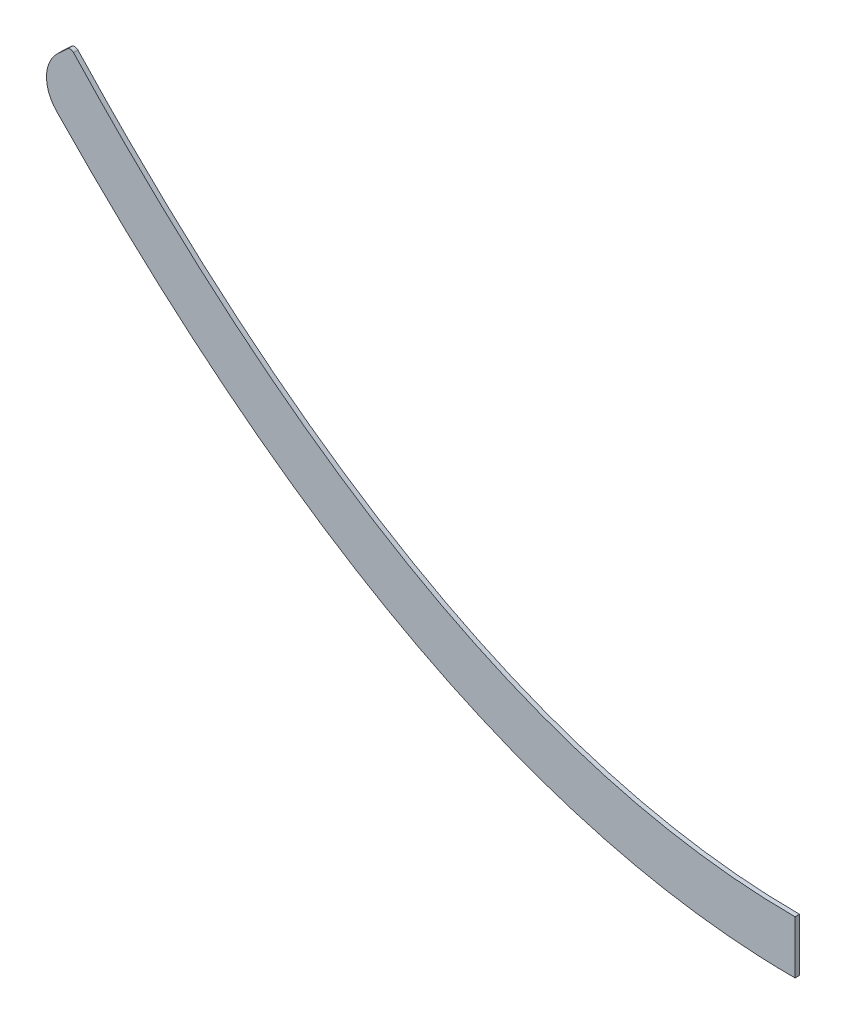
ISO-10303-21;
HEADER;
FILE_DESCRIPTION(('STEP AP214'),'2;1');
FILE_NAME('part.step','',(''),(''),'','','');
FILE_SCHEMA(('AUTOMOTIVE_DESIGN { 1 0 10303 214 1 1 1 1 }'));
ENDSEC;
DATA;
#1=APPLICATION_CONTEXT('core data for automotive mechanical design processes');
#2=APPLICATION_PROTOCOL_DEFINITION('international standard','automotive_design',2000,#1);
#3=PRODUCT_CONTEXT('',#1,'mechanical');
#4=PRODUCT('Part','Part','',(#3));
#5=PRODUCT_RELATED_PRODUCT_CATEGORY('part','',(#4));
#6=PRODUCT_DEFINITION_FORMATION('','',#4);
#7=PRODUCT_DEFINITION_CONTEXT('part definition',#1,'design');
#8=PRODUCT_DEFINITION('design','',#6,#7);
#9=PRODUCT_DEFINITION_SHAPE('','',#8);
#10=(LENGTH_UNIT() NAMED_UNIT(*) SI_UNIT(.MILLI.,.METRE.));
#11=(NAMED_UNIT(*) PLANE_ANGLE_UNIT() SI_UNIT($,.RADIAN.));
#12=(NAMED_UNIT(*) SI_UNIT($,.STERADIAN.) SOLID_ANGLE_UNIT());
#13=UNCERTAINTY_MEASURE_WITH_UNIT(LENGTH_MEASURE(1.E-05),#10,'distance_accuracy_value','');
#14=(GEOMETRIC_REPRESENTATION_CONTEXT(3) GLOBAL_UNCERTAINTY_ASSIGNED_CONTEXT((#13)) GLOBAL_UNIT_ASSIGNED_CONTEXT((#10,
#11,#12)) REPRESENTATION_CONTEXT('',''));
#15=CARTESIAN_POINT('',(0.,0.,0.));
#16=DIRECTION('',(0.,0.,1.));
#17=DIRECTION('',(1.,0.,0.));
#18=AXIS2_PLACEMENT_3D('',#15,#16,#17);
#19=CARTESIAN_POINT('',(45028.5175516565,999415.8,6.35));
#20=CARTESIAN_POINT('',(1092.2,-1000584.2,6.35));
#21=CARTESIAN_POINT('',(-42844.1175516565,999415.8,6.35));
#22=B_SPLINE_CURVE_WITH_KNOTS('',2,(#19,#20,#21),.UNSPECIFIED.,.F.,.F.,(3,3),(0.,1.),.UNSPECIFIED.);
#23=DIRECTION('',(0.,0.,-1.));
#24=VECTOR('',#23,1.);
#25=SURFACE_OF_LINEAR_EXTRUSION('',#22,#24);
#26=CARTESIAN_POINT('',(45028.5175516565,999415.8,0.));
#27=CARTESIAN_POINT('',(1092.2,-1000584.2,0.));
#28=CARTESIAN_POINT('',(-42844.1175516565,999415.8,0.));
#29=B_SPLINE_CURVE_WITH_KNOTS('',2,(#26,#27,#28),.UNSPECIFIED.,.F.,.F.,(3,3),(0.,1.),.UNSPECIFIED.);
#30=CARTESIAN_POINT('',(1092.2,-584.2,0.));
#31=VERTEX_POINT('',#30);
#32=CARTESIAN_POINT('',(55.1123771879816,-27.0352997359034,0.));
#33=VERTEX_POINT('',#32);
#34=EDGE_CURVE('E116',#31,#33,#29,.T.);
#35=ORIENTED_EDGE('',*,*,#34,.T.);
#36=DIRECTION('',(0.,0.,-1.));
#37=VECTOR('',#36,1.);
#38=CARTESIAN_POINT('',(55.1123771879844,-27.0352997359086,0.));
#39=LINE('',#38,#37);
#40=CARTESIAN_POINT('',(55.1123771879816,-27.0352997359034,6.35));
#41=VERTEX_POINT('',#40);
#42=EDGE_CURVE('E139',#33,#41,#39,.F.);
#43=ORIENTED_EDGE('',*,*,#42,.T.);
#44=CARTESIAN_POINT('',(1092.2,-584.2,6.35));
#45=VERTEX_POINT('',#44);
#46=EDGE_CURVE('E133',#45,#41,#22,.T.);
#47=ORIENTED_EDGE('',*,*,#46,.F.);
#48=DIRECTION('',(0.,0.,-1.));
#49=VECTOR('',#48,1.);
#50=CARTESIAN_POINT('',(1092.2,-584.2,6.35));
#51=LINE('',#50,#49);
#52=EDGE_CURVE('E104',#45,#31,#51,.T.);
#53=ORIENTED_EDGE('',*,*,#52,.T.);
#54=EDGE_LOOP('',(#35,#43,#47,#53));
#55=FACE_BOUND('',#54,.T.);
#56=ADVANCED_FACE('F32',(#55),#25,.F.);
#57=CARTESIAN_POINT('',(50.8000000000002,-22.3921052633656,6.35));
#58=DIRECTION('',(0.679764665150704,-0.733430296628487,0.));
#59=DIRECTION('',(0.733430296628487,0.679764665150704,0.));
#60=AXIS2_PLACEMENT_3D('',#57,#58,#59);
#61=PLANE('',#60);
#62=DIRECTION('',(-0.733430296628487,-0.679764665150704,0.));
#63=VECTOR('',#62,1.);
#64=CARTESIAN_POINT('',(50.8000000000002,-22.3921052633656,0.));
#65=LINE('',#64,#63);
#66=CARTESIAN_POINT('',(46.1475304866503,-26.7041501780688,0.));
#67=VERTEX_POINT('',#66);
#68=CARTESIAN_POINT('',(32.4817978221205,-39.3699511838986,0.));
#69=VERTEX_POINT('',#68);
#70=EDGE_CURVE('E121',#67,#69,#65,.T.);
#71=ORIENTED_EDGE('',*,*,#70,.T.);
#72=DIRECTION('',(0.,0.,-1.));
#73=VECTOR('',#72,1.);
#74=CARTESIAN_POINT('',(32.4817978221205,-39.3699511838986,6.35));
#75=LINE('',#74,#73);
#76=CARTESIAN_POINT('',(32.4817978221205,-39.3699511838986,6.35));
#77=VERTEX_POINT('',#76);
#78=EDGE_CURVE('E40',#69,#77,#75,.F.);
#79=ORIENTED_EDGE('',*,*,#78,.T.);
#80=DIRECTION('',(-0.733430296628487,-0.679764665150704,0.));
#81=VECTOR('',#80,1.);
#82=CARTESIAN_POINT('',(50.8000000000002,-22.3921052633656,6.35));
#83=LINE('',#82,#81);
#84=CARTESIAN_POINT('',(46.1475304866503,-26.7041501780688,6.35));
#85=VERTEX_POINT('',#84);
#86=EDGE_CURVE('E95',#85,#77,#83,.T.);
#87=ORIENTED_EDGE('',*,*,#86,.F.);
#88=DIRECTION('',(0.,0.,-1.));
#89=VECTOR('',#88,1.);
#90=CARTESIAN_POINT('',(46.1475304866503,-26.7041501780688,6.35));
#91=LINE('',#90,#89);
#92=EDGE_CURVE('E103',#85,#67,#91,.T.);
#93=ORIENTED_EDGE('',*,*,#92,.T.);
#94=EDGE_LOOP('',(#71,#79,#87,#93));
#95=FACE_BOUND('',#94,.T.);
#96=ADVANCED_FACE('F161',(#95),#61,.F.);
#97=CARTESIAN_POINT('',(-5.08738860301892,-74.1901727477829,6.35));
#98=CARTESIAN_POINT('',(-2.31356824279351,-77.1829789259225,6.35));
#99=CARTESIAN_POINT('',(3.25359668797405,-83.1662300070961,6.35));
#100=CARTESIAN_POINT('',(14.3717913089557,-95.0215577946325,6.35));
#101=CARTESIAN_POINT('',(28.2827778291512,-109.679086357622,6.35));
#102=CARTESIAN_POINT('',(44.9838086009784,-126.994751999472,6.35));
#103=CARTESIAN_POINT('',(67.2675234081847,-149.722931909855,6.35));
#104=CARTESIAN_POINT('',(95.1500395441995,-177.456721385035,6.35));
#105=CARTESIAN_POINT('',(128.656686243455,-209.654928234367,6.35));
#106=CARTESIAN_POINT('',(162.213165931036,-240.769612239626,6.35));
#107=CARTESIAN_POINT('',(207.024898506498,-280.809633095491,6.35));
#108=CARTESIAN_POINT('',(263.176496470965,-328.144569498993,6.35));
#109=CARTESIAN_POINT('',(330.797274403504,-380.588231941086,6.35));
#110=CARTESIAN_POINT('',(398.675890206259,-428.654811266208,6.35));
#111=CARTESIAN_POINT('',(466.829526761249,-472.320489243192,6.35));
#112=CARTESIAN_POINT('',(558.085229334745,-524.634026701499,6.35));
#113=CARTESIAN_POINT('',(672.900055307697,-578.864849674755,6.35));
#114=CARTESIAN_POINT('',(811.846430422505,-625.75049604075,6.35));
#115=CARTESIAN_POINT('',(928.42946360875,-649.357251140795,6.35));
#116=CARTESIAN_POINT('',(1021.97838971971,-658.820984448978,6.35));
#117=CARTESIAN_POINT('',(1068.7819211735,-660.400000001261,6.35));
#118=CARTESIAN_POINT('',(1092.20000005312,-660.400000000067,6.35));
#119=B_SPLINE_CURVE_WITH_KNOTS('',3,(#97,#98,#99,#100,#101,#102,#103,#104,#105,#106,#107,#108,
#109,#110,#111,#112,#113,#114,#115,#116,#117,#118),.UNSPECIFIED.,.F.,.F.,(4,1,1,1,1,1,1,1,1,1,1,
1,1,1,1,1,1,1,1,4),(0.488148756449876,0.488241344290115,0.488333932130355,0.488519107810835,
0.488704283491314,0.488889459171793,0.489259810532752,0.489630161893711,0.49000051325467,
0.490370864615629,0.491111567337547,0.491852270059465,0.492592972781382,0.4933336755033,
0.494074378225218,0.495555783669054,0.497037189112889,0.498518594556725,0.499259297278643,
0.50000000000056),.UNSPECIFIED.);
#120=DIRECTION('',(0.,0.,-1.));
#121=VECTOR('',#120,1.);
#122=SURFACE_OF_LINEAR_EXTRUSION('',#119,#121);
#123=CARTESIAN_POINT('',(30.3423115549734,-111.782709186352,6.35));
#124=VERTEX_POINT('',#123);
#125=CARTESIAN_POINT('',(1092.20000005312,-660.400000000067,6.35));
#126=VERTEX_POINT('',#125);
#127=EDGE_CURVE('E84',#124,#126,#119,.T.);
#128=ORIENTED_EDGE('',*,*,#127,.F.);
#129=DIRECTION('',(0.,0.,-1.));
#130=VECTOR('',#129,1.);
#131=CARTESIAN_POINT('',(30.3423115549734,-111.782709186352,6.35));
#132=LINE('',#131,#130);
#133=CARTESIAN_POINT('',(30.3423115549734,-111.782709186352,0.));
#134=VERTEX_POINT('',#133);
#135=EDGE_CURVE('E143',#124,#134,#132,.T.);
#136=ORIENTED_EDGE('',*,*,#135,.T.);
#137=CARTESIAN_POINT('',(-5.08738860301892,-74.1901727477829,0.));
#138=CARTESIAN_POINT('',(-2.31356824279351,-77.1829789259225,0.));
#139=CARTESIAN_POINT('',(3.25359668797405,-83.1662300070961,0.));
#140=CARTESIAN_POINT('',(14.3717913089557,-95.0215577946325,0.));
#141=CARTESIAN_POINT('',(28.2827778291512,-109.679086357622,0.));
#142=CARTESIAN_POINT('',(44.9838086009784,-126.994751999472,0.));
#143=CARTESIAN_POINT('',(67.2675234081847,-149.722931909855,0.));
#144=CARTESIAN_POINT('',(95.1500395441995,-177.456721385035,0.));
#145=CARTESIAN_POINT('',(128.656686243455,-209.654928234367,0.));
#146=CARTESIAN_POINT('',(162.213165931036,-240.769612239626,0.));
#147=CARTESIAN_POINT('',(207.024898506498,-280.809633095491,0.));
#148=CARTESIAN_POINT('',(263.176496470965,-328.144569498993,0.));
#149=CARTESIAN_POINT('',(330.797274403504,-380.588231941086,0.));
#150=CARTESIAN_POINT('',(398.675890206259,-428.654811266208,0.));
#151=CARTESIAN_POINT('',(466.829526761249,-472.320489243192,0.));
#152=CARTESIAN_POINT('',(558.085229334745,-524.634026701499,0.));
#153=CARTESIAN_POINT('',(672.900055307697,-578.864849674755,0.));
#154=CARTESIAN_POINT('',(811.846430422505,-625.75049604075,0.));
#155=CARTESIAN_POINT('',(928.42946360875,-649.357251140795,0.));
#156=CARTESIAN_POINT('',(1021.97838971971,-658.820984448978,0.));
#157=CARTESIAN_POINT('',(1068.7819211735,-660.400000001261,0.));
#158=CARTESIAN_POINT('',(1092.20000005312,-660.400000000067,0.));
#159=B_SPLINE_CURVE_WITH_KNOTS('',3,(#137,#138,#139,#140,#141,#142,#143,#144,#145,#146,#147,
#148,#149,#150,#151,#152,#153,#154,#155,#156,#157,#158),.UNSPECIFIED.,.F.,.F.,(4,1,1,1,1,1,1,1,
1,1,1,1,1,1,1,1,1,1,1,4),(0.488148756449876,0.488241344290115,0.488333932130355,
0.488519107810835,0.488704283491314,0.488889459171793,0.489259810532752,0.489630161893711,
0.49000051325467,0.490370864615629,0.491111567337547,0.491852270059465,0.492592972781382,
0.4933336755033,0.494074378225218,0.495555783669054,0.497037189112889,0.498518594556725,
0.499259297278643,0.50000000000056),.UNSPECIFIED.);
#160=CARTESIAN_POINT('',(1092.20000005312,-660.400000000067,0.));
#161=VERTEX_POINT('',#160);
#162=EDGE_CURVE('E100',#134,#161,#159,.T.);
#163=ORIENTED_EDGE('',*,*,#162,.T.);
#164=DIRECTION('',(0.,0.,-1.));
#165=VECTOR('',#164,1.);
#166=CARTESIAN_POINT('',(1092.20000005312,-660.400000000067,6.35));
#167=LINE('',#166,#165);
#168=EDGE_CURVE('E98',#126,#161,#167,.T.);
#169=ORIENTED_EDGE('',*,*,#168,.F.);
#170=EDGE_LOOP('',(#128,#136,#163,#169));
#171=FACE_BOUND('',#170,.T.);
#172=ADVANCED_FACE('F99',(#171),#122,.F.);
#173=CARTESIAN_POINT('',(1092.2,-584.2,6.35));
#174=DIRECTION('',(-1.,-6.97144296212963E-10,0.));
#175=DIRECTION('',(6.97144296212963E-10,-1.,0.));
#176=AXIS2_PLACEMENT_3D('',#173,#174,#175);
#177=PLANE('',#176);
#178=DIRECTION('',(-6.97144296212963E-10,1.,0.));
#179=VECTOR('',#178,1.);
#180=CARTESIAN_POINT('',(1092.2,-584.2,0.));
#181=LINE('',#180,#179);
#182=EDGE_CURVE('E129',#161,#31,#181,.T.);
#183=ORIENTED_EDGE('',*,*,#182,.T.);
#184=ORIENTED_EDGE('',*,*,#52,.F.);
#185=DIRECTION('',(-6.97144296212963E-10,1.,0.));
#186=VECTOR('',#185,1.);
#187=CARTESIAN_POINT('',(1092.2,-584.2,6.35));
#188=LINE('',#187,#186);
#189=EDGE_CURVE('E89',#126,#45,#188,.T.);
#190=ORIENTED_EDGE('',*,*,#189,.F.);
#191=ORIENTED_EDGE('',*,*,#168,.T.);
#192=EDGE_LOOP('',(#183,#184,#190,#191));
#193=FACE_BOUND('',#192,.T.);
#194=ADVANCED_FACE('F106',(#193),#177,.F.);
#195=CARTESIAN_POINT('',(1092.2,-584.200000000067,6.35));
#196=DIRECTION('',(0.,0.,-1.));
#197=DIRECTION('',(-1.,0.,0.));
#198=AXIS2_PLACEMENT_3D('',#195,#196,#197);
#199=PLANE('',#198);
#200=ORIENTED_EDGE('',*,*,#86,.T.);
#201=CARTESIAN_POINT('',(67.0138428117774,-76.628210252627,6.35));
#202=DIRECTION('',(0.,0.,-1.));
#203=DIRECTION('',(-1.,0.,0.));
#204=AXIS2_PLACEMENT_3D('',#201,#202,#203);
#205=CIRCLE('',#204,50.8);
#206=EDGE_CURVE('E11',#77,#124,#205,.F.);
#207=ORIENTED_EDGE('',*,*,#206,.T.);
#208=ORIENTED_EDGE('',*,*,#127,.T.);
#209=ORIENTED_EDGE('',*,*,#189,.T.);
#210=ORIENTED_EDGE('',*,*,#46,.T.);
#211=CARTESIAN_POINT('',(50.4640361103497,-31.3614325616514,6.35));
#212=DIRECTION('',(0.,0.,-1.));
#213=DIRECTION('',(-1.,0.,0.));
#214=AXIS2_PLACEMENT_3D('',#211,#212,#213);
#215=CIRCLE('',#214,6.35);
#216=EDGE_CURVE('E141',#41,#85,#215,.F.);
#217=ORIENTED_EDGE('',*,*,#216,.T.);
#218=EDGE_LOOP('',(#200,#207,#208,#209,#210,#217));
#219=FACE_BOUND('',#218,.T.);
#220=ADVANCED_FACE('F86',(#219),#199,.F.);
#221=CARTESIAN_POINT('',(1092.2,-584.200000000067,0.));
#222=DIRECTION('',(0.,0.,-1.));
#223=DIRECTION('',(-1.,0.,0.));
#224=AXIS2_PLACEMENT_3D('',#221,#222,#223);
#225=PLANE('',#224);
#226=ORIENTED_EDGE('',*,*,#162,.F.);
#227=CARTESIAN_POINT('',(67.0138428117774,-76.628210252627,0.));
#228=DIRECTION('',(0.,0.,-1.));
#229=DIRECTION('',(-1.,0.,0.));
#230=AXIS2_PLACEMENT_3D('',#227,#228,#229);
#231=CIRCLE('',#230,50.8);
#232=EDGE_CURVE('E54',#134,#69,#231,.T.);
#233=ORIENTED_EDGE('',*,*,#232,.T.);
#234=ORIENTED_EDGE('',*,*,#70,.F.);
#235=CARTESIAN_POINT('',(50.4640361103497,-31.3614325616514,0.));
#236=DIRECTION('',(0.,0.,-1.));
#237=DIRECTION('',(-1.,0.,0.));
#238=AXIS2_PLACEMENT_3D('',#235,#236,#237);
#239=CIRCLE('',#238,6.35);
#240=EDGE_CURVE('E137',#67,#33,#239,.T.);
#241=ORIENTED_EDGE('',*,*,#240,.T.);
#242=ORIENTED_EDGE('',*,*,#34,.F.);
#243=ORIENTED_EDGE('',*,*,#182,.F.);
#244=EDGE_LOOP('',(#226,#233,#234,#241,#242,#243));
#245=FACE_BOUND('',#244,.T.);
#246=ADVANCED_FACE('F146',(#245),#225,.T.);
#247=CARTESIAN_POINT('',(50.4640361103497,-31.3614325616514,3.175));
#248=DIRECTION('',(0.,0.,-1.));
#249=DIRECTION('',(-1.,0.,0.));
#250=AXIS2_PLACEMENT_3D('',#247,#248,#249);
#251=CYLINDRICAL_SURFACE('',#250,6.35);
#252=ORIENTED_EDGE('',*,*,#216,.F.);
#253=ORIENTED_EDGE('',*,*,#42,.F.);
#254=ORIENTED_EDGE('',*,*,#240,.F.);
#255=ORIENTED_EDGE('',*,*,#92,.F.);
#256=EDGE_LOOP('',(#252,#253,#254,#255));
#257=FACE_BOUND('',#256,.T.);
#258=ADVANCED_FACE('F163',(#257),#251,.T.);
#259=CARTESIAN_POINT('',(67.0138428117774,-76.628210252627,3.175));
#260=DIRECTION('',(0.,0.,-1.));
#261=DIRECTION('',(-1.,0.,0.));
#262=AXIS2_PLACEMENT_3D('',#259,#260,#261);
#263=CYLINDRICAL_SURFACE('',#262,50.8);
#264=ORIENTED_EDGE('',*,*,#206,.F.);
#265=ORIENTED_EDGE('',*,*,#78,.F.);
#266=ORIENTED_EDGE('',*,*,#232,.F.);
#267=ORIENTED_EDGE('',*,*,#135,.F.);
#268=EDGE_LOOP('',(#264,#265,#266,#267));
#269=FACE_BOUND('',#268,.T.);
#270=ADVANCED_FACE('F34',(#269),#263,.T.);
#271=CLOSED_SHELL('',(#56,#96,#172,#194,#220,#246,#258,#270));
#272=MANIFOLD_SOLID_BREP('B2',#271);
#273=ADVANCED_BREP_SHAPE_REPRESENTATION('',(#18,#272),#14);
#274=SHAPE_DEFINITION_REPRESENTATION(#9,#273);
ENDSEC;
END-ISO-10303-21;
